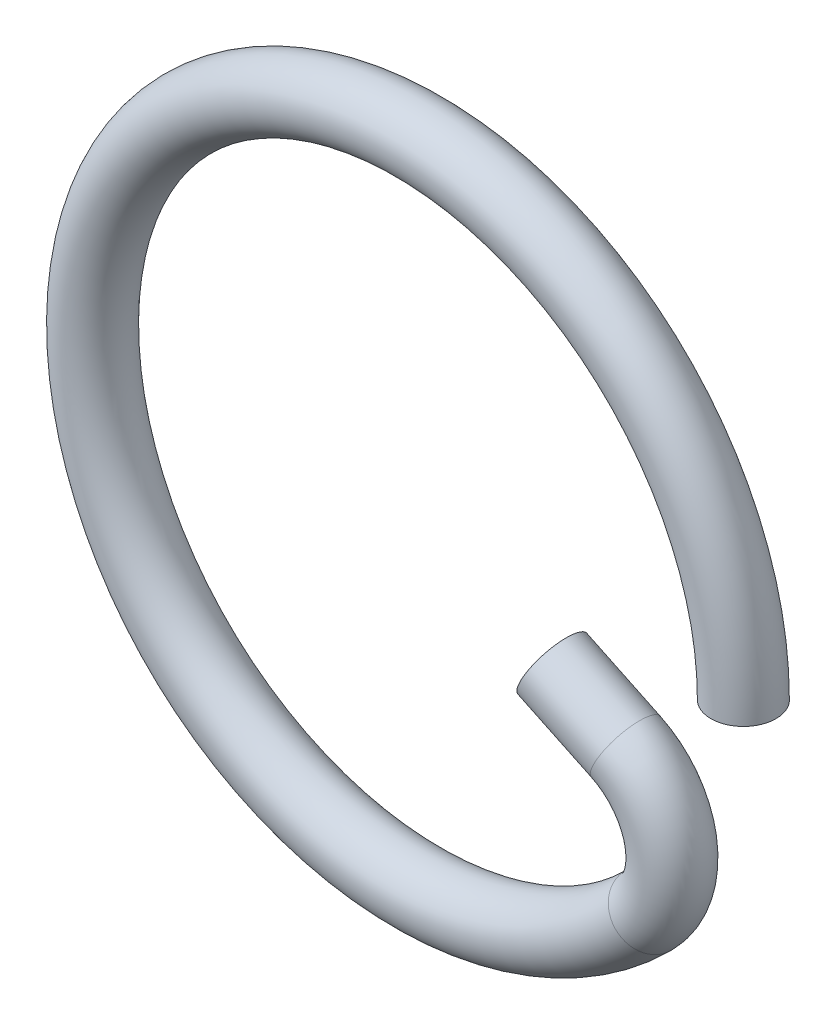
from build123d import *

# Parameters (mm, degrees)
SKETCH2_R = 0.2


with BuildPart() as part:
    # Sweep1: sweep along a path in Sketch1
    with BuildLine(Plane.XY) as sweep1_path:
        Line((0.824957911, -0.393993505), (1.276142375, -0.609475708))
        ThreePointArc((1.276142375, -0.609475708), (1.553459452, -0.976109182), (1.414213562, -1.414213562))
        ThreePointArc((1.414213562, -1.414213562), (-1.847759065, 0.765366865), (2, 0))
    # Sketch2 → Sweep1 (sweep)
    with BuildSketch(Plane(origin=(0, 0, 0), x_dir=(1, 0, 0), z_dir=(0, 1, 0))):
        with Locations((2, 0)):
            Circle(SKETCH2_R)
    sweep(path=sweep1_path.line)


solid = part.part
